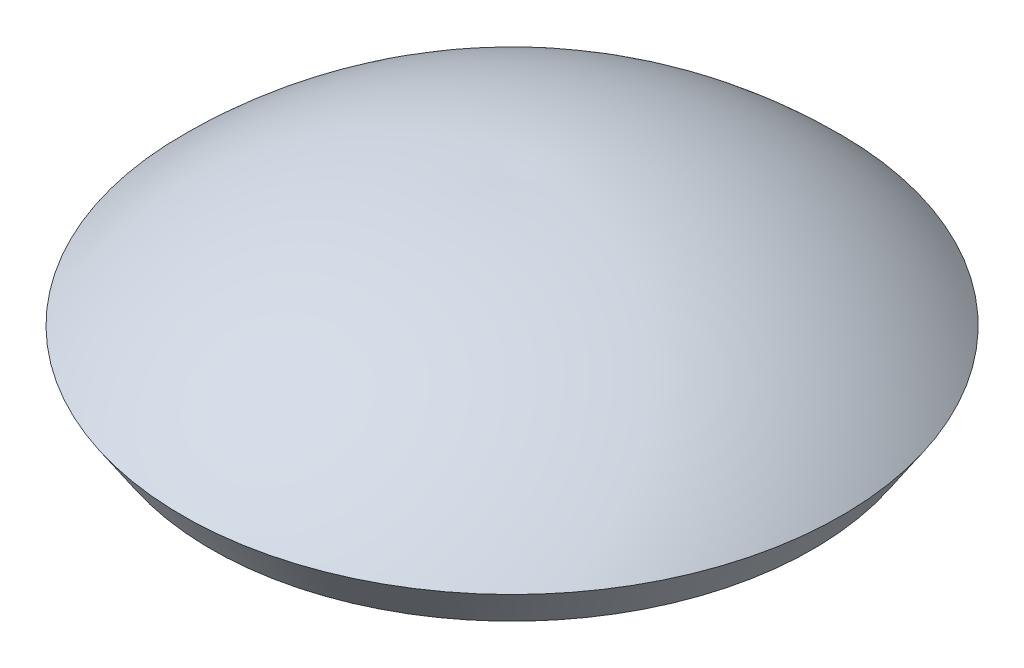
from build123d import *


with BuildPart() as part:
    # Varredura1: sweep along a path in Esbo_o2
    with BuildLine(Plane(origin=(0, 0, 0), x_dir=(1, 0, 0), z_dir=(0, 1, 0))) as varredura1_path:
        CenterArc((0, 0), 18.9, 0, 360)
    # Esbo_o1 → Varredura1 (sweep)
    with BuildSketch(Plane.XY):
        with BuildLine():
            Line((0, 7.4), (0, 4.4))
            ThreePointArc((0, 4.4), (9.285550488, 2.610965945), (17.241687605, -2.5))
            Line((17.241687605, -2.5), (18.9, 0))
            ThreePointArc((18.9, 0), (10.234775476, 5.704358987), (0, 7.4))
        make_face()
    sweep(path=varredura1_path.line)


solid = part.part
